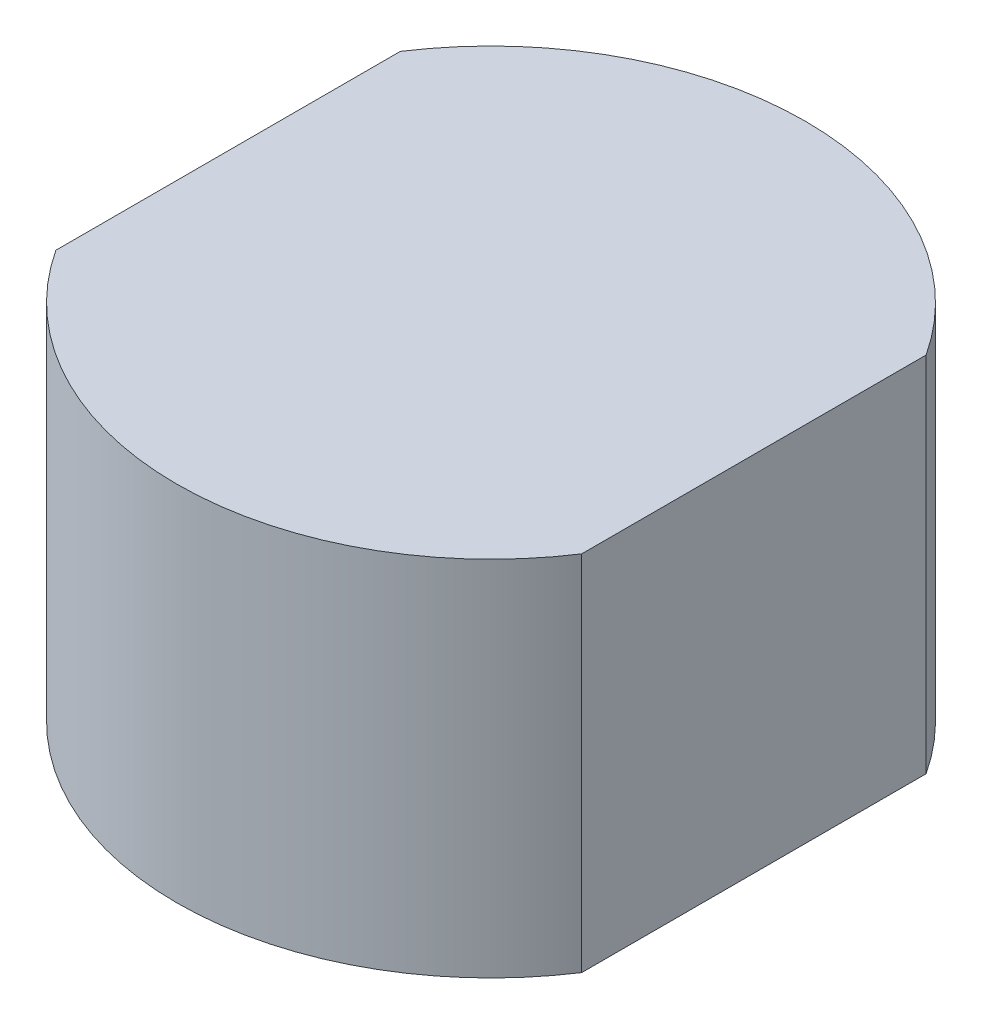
ISO-10303-21;
HEADER;
FILE_DESCRIPTION(('STEP AP214'),'2;1');
FILE_NAME('part.step','',(''),(''),'','','');
FILE_SCHEMA(('AUTOMOTIVE_DESIGN { 1 0 10303 214 1 1 1 1 }'));
ENDSEC;
DATA;
#1=APPLICATION_CONTEXT('core data for automotive mechanical design processes');
#2=APPLICATION_PROTOCOL_DEFINITION('international standard','automotive_design',2000,#1);
#3=PRODUCT_CONTEXT('',#1,'mechanical');
#4=PRODUCT('Part','Part','',(#3));
#5=PRODUCT_RELATED_PRODUCT_CATEGORY('part','',(#4));
#6=PRODUCT_DEFINITION_FORMATION('','',#4);
#7=PRODUCT_DEFINITION_CONTEXT('part definition',#1,'design');
#8=PRODUCT_DEFINITION('design','',#6,#7);
#9=PRODUCT_DEFINITION_SHAPE('','',#8);
#10=(LENGTH_UNIT() NAMED_UNIT(*) SI_UNIT(.MILLI.,.METRE.));
#11=(NAMED_UNIT(*) PLANE_ANGLE_UNIT() SI_UNIT($,.RADIAN.));
#12=(NAMED_UNIT(*) SI_UNIT($,.STERADIAN.) SOLID_ANGLE_UNIT());
#13=UNCERTAINTY_MEASURE_WITH_UNIT(LENGTH_MEASURE(1.E-05),#10,'distance_accuracy_value','');
#14=(GEOMETRIC_REPRESENTATION_CONTEXT(3) GLOBAL_UNCERTAINTY_ASSIGNED_CONTEXT((#13)) GLOBAL_UNIT_ASSIGNED_CONTEXT((#10,
#11,#12)) REPRESENTATION_CONTEXT('',''));
#15=CARTESIAN_POINT('',(0.,0.,0.));
#16=DIRECTION('',(0.,0.,1.));
#17=DIRECTION('',(1.,0.,0.));
#18=AXIS2_PLACEMENT_3D('',#15,#16,#17);
#19=CARTESIAN_POINT('',(0.,0.,0.));
#20=DIRECTION('',(0.,1.,0.));
#21=DIRECTION('',(0.,0.,1.));
#22=AXIS2_PLACEMENT_3D('',#19,#20,#21);
#23=PLANE('',#22);
#24=DIRECTION('',(0.,0.,-1.));
#25=VECTOR('',#24,1.);
#26=CARTESIAN_POINT('',(-43.5,0.,-28.4912267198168));
#27=LINE('',#26,#25);
#28=CARTESIAN_POINT('',(-43.5,0.,28.4912267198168));
#29=VERTEX_POINT('',#28);
#30=CARTESIAN_POINT('',(-43.5,0.,-28.4912267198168));
#31=VERTEX_POINT('',#30);
#32=EDGE_CURVE('E54',#29,#31,#27,.T.);
#33=ORIENTED_EDGE('',*,*,#32,.T.);
#34=CARTESIAN_POINT('',(0.,0.,0.));
#35=DIRECTION('',(0.,-1.,0.));
#36=DIRECTION('',(0.,0.,-1.));
#37=AXIS2_PLACEMENT_3D('',#34,#35,#36);
#38=CIRCLE('',#37,52.);
#39=CARTESIAN_POINT('',(43.5,0.,-28.4912267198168));
#40=VERTEX_POINT('',#39);
#41=EDGE_CURVE('E62',#40,#31,#38,.F.);
#42=ORIENTED_EDGE('',*,*,#41,.F.);
#43=DIRECTION('',(0.,0.,1.));
#44=VECTOR('',#43,1.);
#45=CARTESIAN_POINT('',(43.5,0.,-28.4912267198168));
#46=LINE('',#45,#44);
#47=CARTESIAN_POINT('',(43.5,0.,28.4912267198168));
#48=VERTEX_POINT('',#47);
#49=EDGE_CURVE('E58',#40,#48,#46,.T.);
#50=ORIENTED_EDGE('',*,*,#49,.T.);
#51=CARTESIAN_POINT('',(0.,0.,0.));
#52=DIRECTION('',(0.,-1.,0.));
#53=DIRECTION('',(0.,0.,-1.));
#54=AXIS2_PLACEMENT_3D('',#51,#52,#53);
#55=CIRCLE('',#54,52.);
#56=EDGE_CURVE('E20',#29,#48,#55,.F.);
#57=ORIENTED_EDGE('',*,*,#56,.F.);
#58=EDGE_LOOP('',(#33,#42,#50,#57));
#59=FACE_BOUND('',#58,.T.);
#60=ADVANCED_FACE('F17',(#59),#23,.F.);
#61=CARTESIAN_POINT('',(-43.5,0.,-28.4912267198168));
#62=DIRECTION('',(1.,0.,0.));
#63=DIRECTION('',(0.,0.,-1.));
#64=AXIS2_PLACEMENT_3D('',#61,#62,#63);
#65=PLANE('',#64);
#66=DIRECTION('',(0.,-1.,0.));
#67=VECTOR('',#66,1.);
#68=CARTESIAN_POINT('',(-43.5,60.,-28.4912267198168));
#69=LINE('',#68,#67);
#70=CARTESIAN_POINT('',(-43.5,60.,-28.4912267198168));
#71=VERTEX_POINT('',#70);
#72=EDGE_CURVE('E81',#31,#71,#69,.F.);
#73=ORIENTED_EDGE('',*,*,#72,.F.);
#74=ORIENTED_EDGE('',*,*,#32,.F.);
#75=DIRECTION('',(0.,-1.,0.));
#76=VECTOR('',#75,1.);
#77=CARTESIAN_POINT('',(-43.5,60.,28.4912267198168));
#78=LINE('',#77,#76);
#79=CARTESIAN_POINT('',(-43.5,60.,28.4912267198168));
#80=VERTEX_POINT('',#79);
#81=EDGE_CURVE('E69',#80,#29,#78,.T.);
#82=ORIENTED_EDGE('',*,*,#81,.F.);
#83=DIRECTION('',(0.,0.,1.));
#84=VECTOR('',#83,1.);
#85=CARTESIAN_POINT('',(-43.5,60.,0.));
#86=LINE('',#85,#84);
#87=EDGE_CURVE('E80',#71,#80,#86,.T.);
#88=ORIENTED_EDGE('',*,*,#87,.F.);
#89=EDGE_LOOP('',(#73,#74,#82,#88));
#90=FACE_BOUND('',#89,.T.);
#91=ADVANCED_FACE('F90',(#90),#65,.F.);
#92=CARTESIAN_POINT('',(0.,60.,0.));
#93=DIRECTION('',(0.,-1.,0.));
#94=DIRECTION('',(0.,0.,-1.));
#95=AXIS2_PLACEMENT_3D('',#92,#93,#94);
#96=CYLINDRICAL_SURFACE('',#95,52.);
#97=ORIENTED_EDGE('',*,*,#56,.T.);
#98=DIRECTION('',(0.,1.,0.));
#99=VECTOR('',#98,1.);
#100=CARTESIAN_POINT('',(43.5,0.,28.4912267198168));
#101=LINE('',#100,#99);
#102=CARTESIAN_POINT('',(43.5,60.,28.4912267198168));
#103=VERTEX_POINT('',#102);
#104=EDGE_CURVE('E64',#48,#103,#101,.T.);
#105=ORIENTED_EDGE('',*,*,#104,.T.);
#106=CARTESIAN_POINT('',(0.,60.,0.));
#107=DIRECTION('',(0.,-1.,0.));
#108=DIRECTION('',(0.,0.,-1.));
#109=AXIS2_PLACEMENT_3D('',#106,#107,#108);
#110=CIRCLE('',#109,52.);
#111=EDGE_CURVE('E79',#80,#103,#110,.F.);
#112=ORIENTED_EDGE('',*,*,#111,.F.);
#113=ORIENTED_EDGE('',*,*,#81,.T.);
#114=EDGE_LOOP('',(#97,#105,#112,#113));
#115=FACE_BOUND('',#114,.T.);
#116=ADVANCED_FACE('F67',(#115),#96,.T.);
#117=CARTESIAN_POINT('',(43.5,0.,-28.4912267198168));
#118=DIRECTION('',(-1.,0.,0.));
#119=DIRECTION('',(0.,0.,1.));
#120=AXIS2_PLACEMENT_3D('',#117,#118,#119);
#121=PLANE('',#120);
#122=ORIENTED_EDGE('',*,*,#104,.F.);
#123=ORIENTED_EDGE('',*,*,#49,.F.);
#124=DIRECTION('',(0.,-1.,0.));
#125=VECTOR('',#124,1.);
#126=CARTESIAN_POINT('',(43.5,60.,-28.4912267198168));
#127=LINE('',#126,#125);
#128=CARTESIAN_POINT('',(43.5,60.,-28.4912267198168));
#129=VERTEX_POINT('',#128);
#130=EDGE_CURVE('E35',#129,#40,#127,.T.);
#131=ORIENTED_EDGE('',*,*,#130,.F.);
#132=DIRECTION('',(0.,0.,1.));
#133=VECTOR('',#132,1.);
#134=CARTESIAN_POINT('',(43.5,60.,0.));
#135=LINE('',#134,#133);
#136=EDGE_CURVE('E26',#103,#129,#135,.F.);
#137=ORIENTED_EDGE('',*,*,#136,.F.);
#138=EDGE_LOOP('',(#122,#123,#131,#137));
#139=FACE_BOUND('',#138,.T.);
#140=ADVANCED_FACE('F70',(#139),#121,.F.);
#141=CARTESIAN_POINT('',(0.,60.,0.));
#142=DIRECTION('',(0.,-1.,0.));
#143=DIRECTION('',(0.,0.,-1.));
#144=AXIS2_PLACEMENT_3D('',#141,#142,#143);
#145=CYLINDRICAL_SURFACE('',#144,52.);
#146=ORIENTED_EDGE('',*,*,#41,.T.);
#147=ORIENTED_EDGE('',*,*,#72,.T.);
#148=CARTESIAN_POINT('',(0.,60.,0.));
#149=DIRECTION('',(0.,-1.,0.));
#150=DIRECTION('',(0.,0.,-1.));
#151=AXIS2_PLACEMENT_3D('',#148,#149,#150);
#152=CIRCLE('',#151,52.);
#153=EDGE_CURVE('E10',#129,#71,#152,.F.);
#154=ORIENTED_EDGE('',*,*,#153,.F.);
#155=ORIENTED_EDGE('',*,*,#130,.T.);
#156=EDGE_LOOP('',(#146,#147,#154,#155));
#157=FACE_BOUND('',#156,.T.);
#158=ADVANCED_FACE('F99',(#157),#145,.T.);
#159=CARTESIAN_POINT('',(0.,60.,0.));
#160=DIRECTION('',(0.,1.,0.));
#161=DIRECTION('',(0.,0.,1.));
#162=AXIS2_PLACEMENT_3D('',#159,#160,#161);
#163=PLANE('',#162);
#164=ORIENTED_EDGE('',*,*,#153,.T.);
#165=ORIENTED_EDGE('',*,*,#87,.T.);
#166=ORIENTED_EDGE('',*,*,#111,.T.);
#167=ORIENTED_EDGE('',*,*,#136,.T.);
#168=EDGE_LOOP('',(#164,#165,#166,#167));
#169=FACE_BOUND('',#168,.T.);
#170=ADVANCED_FACE('F88',(#169),#163,.T.);
#171=CLOSED_SHELL('',(#60,#91,#116,#140,#158,#170));
#172=MANIFOLD_SOLID_BREP('B1',#171);
#173=ADVANCED_BREP_SHAPE_REPRESENTATION('',(#18,#172),#14);
#174=SHAPE_DEFINITION_REPRESENTATION(#9,#173);
ENDSEC;
END-ISO-10303-21;
